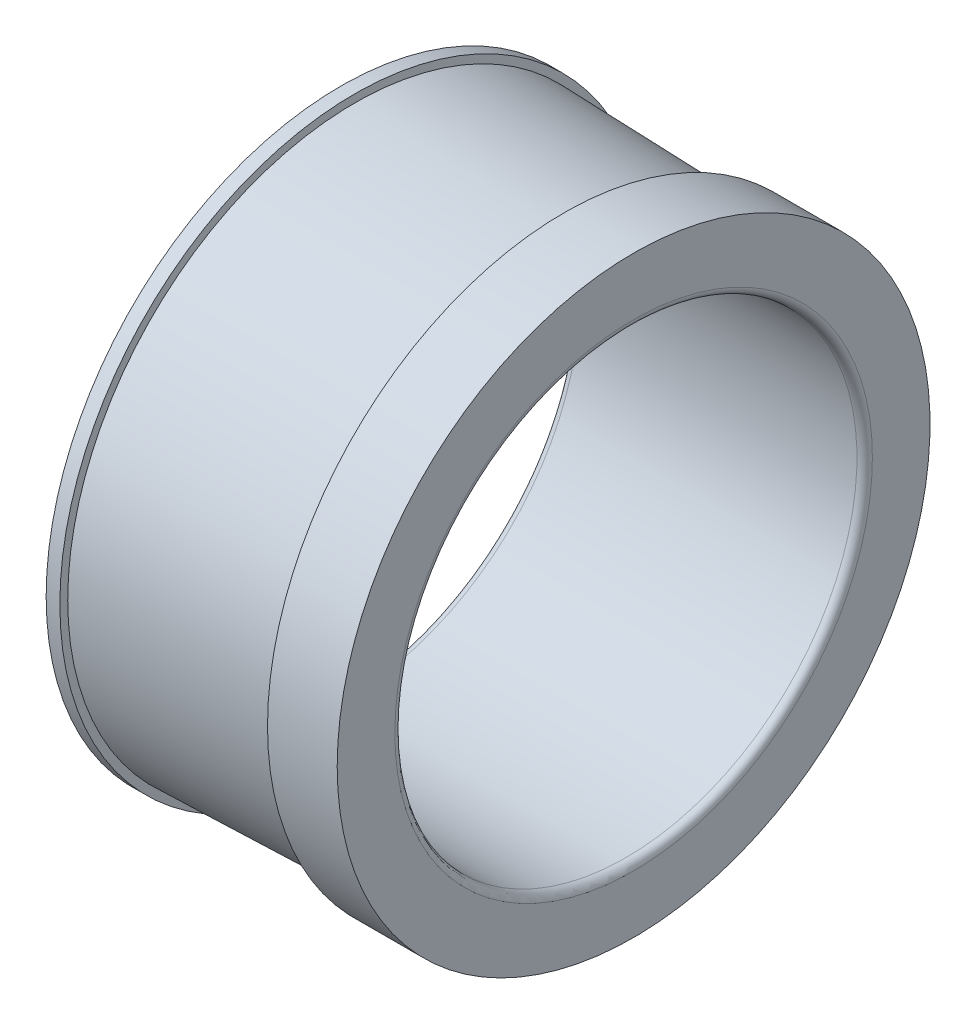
ISO-10303-21;
HEADER;
FILE_DESCRIPTION(('STEP AP214'),'2;1');
FILE_NAME('part.step','',(''),(''),'','','');
FILE_SCHEMA(('AUTOMOTIVE_DESIGN { 1 0 10303 214 1 1 1 1 }'));
ENDSEC;
DATA;
#1=APPLICATION_CONTEXT('core data for automotive mechanical design processes');
#2=APPLICATION_PROTOCOL_DEFINITION('international standard','automotive_design',2000,#1);
#3=PRODUCT_CONTEXT('',#1,'mechanical');
#4=PRODUCT('Part','Part','',(#3));
#5=PRODUCT_RELATED_PRODUCT_CATEGORY('part','',(#4));
#6=PRODUCT_DEFINITION_FORMATION('','',#4);
#7=PRODUCT_DEFINITION_CONTEXT('part definition',#1,'design');
#8=PRODUCT_DEFINITION('design','',#6,#7);
#9=PRODUCT_DEFINITION_SHAPE('','',#8);
#10=(LENGTH_UNIT() NAMED_UNIT(*) SI_UNIT(.MILLI.,.METRE.));
#11=(NAMED_UNIT(*) PLANE_ANGLE_UNIT() SI_UNIT($,.RADIAN.));
#12=(NAMED_UNIT(*) SI_UNIT($,.STERADIAN.) SOLID_ANGLE_UNIT());
#13=UNCERTAINTY_MEASURE_WITH_UNIT(LENGTH_MEASURE(1.E-05),#10,'distance_accuracy_value','');
#14=(GEOMETRIC_REPRESENTATION_CONTEXT(3) GLOBAL_UNCERTAINTY_ASSIGNED_CONTEXT((#13)) GLOBAL_UNIT_ASSIGNED_CONTEXT((#10,
#11,#12)) REPRESENTATION_CONTEXT('',''));
#15=CARTESIAN_POINT('',(0.,0.,0.));
#16=DIRECTION('',(0.,0.,1.));
#17=DIRECTION('',(1.,0.,0.));
#18=AXIS2_PLACEMENT_3D('',#15,#16,#17);
#19=CARTESIAN_POINT('',(1.,0.,0.));
#20=DIRECTION('',(-1.,0.,0.));
#21=DIRECTION('',(0.,0.,1.));
#22=AXIS2_PLACEMENT_3D('',#19,#20,#21);
#23=TOROIDAL_SURFACE('',#22,31.,1.);
#24=CARTESIAN_POINT('',(1.,0.,0.));
#25=DIRECTION('',(-1.,0.,0.));
#26=DIRECTION('',(0.,0.,1.));
#27=AXIS2_PLACEMENT_3D('',#24,#25,#26);
#28=CIRCLE('',#27,30.);
#29=CARTESIAN_POINT('',(1.,0.,30.));
#30=VERTEX_POINT('',#29);
#31=EDGE_CURVE('E10',#30,#30,#28,.T.);
#32=ORIENTED_EDGE('',*,*,#31,.F.);
#33=EDGE_LOOP('',(#32));
#34=FACE_BOUND('',#33,.T.);
#35=CARTESIAN_POINT('',(0.,0.,0.));
#36=DIRECTION('',(-1.,0.,0.));
#37=DIRECTION('',(0.,0.,1.));
#38=AXIS2_PLACEMENT_3D('',#35,#36,#37);
#39=CIRCLE('',#38,31.);
#40=CARTESIAN_POINT('',(0.,0.,31.));
#41=VERTEX_POINT('',#40);
#42=EDGE_CURVE('E63',#41,#41,#39,.T.);
#43=ORIENTED_EDGE('',*,*,#42,.T.);
#44=EDGE_LOOP('',(#43));
#45=FACE_BOUND('',#44,.T.);
#46=ADVANCED_FACE('F29',(#34,#45),#23,.T.);
#47=CARTESIAN_POINT('',(0.,0.,0.));
#48=DIRECTION('',(-1.,0.,0.));
#49=DIRECTION('',(0.,0.,1.));
#50=AXIS2_PLACEMENT_3D('',#47,#48,#49);
#51=CYLINDRICAL_SURFACE('',#50,30.);
#52=CARTESIAN_POINT('',(37.,0.,0.));
#53=DIRECTION('',(-1.,0.,0.));
#54=DIRECTION('',(0.,0.,1.));
#55=AXIS2_PLACEMENT_3D('',#52,#53,#54);
#56=CIRCLE('',#55,30.);
#57=CARTESIAN_POINT('',(37.,0.,30.));
#58=VERTEX_POINT('',#57);
#59=EDGE_CURVE('E35',#58,#58,#56,.T.);
#60=ORIENTED_EDGE('',*,*,#59,.F.);
#61=EDGE_LOOP('',(#60));
#62=FACE_BOUND('',#61,.T.);
#63=ORIENTED_EDGE('',*,*,#31,.T.);
#64=EDGE_LOOP('',(#63));
#65=FACE_BOUND('',#64,.T.);
#66=ADVANCED_FACE('F112',(#62,#65),#51,.F.);
#67=CARTESIAN_POINT('',(37.,0.,0.));
#68=DIRECTION('',(-1.,0.,0.));
#69=DIRECTION('',(0.,0.,1.));
#70=AXIS2_PLACEMENT_3D('',#67,#68,#69);
#71=TOROIDAL_SURFACE('',#70,31.,1.);
#72=CARTESIAN_POINT('',(38.,0.,0.));
#73=DIRECTION('',(-1.,0.,0.));
#74=DIRECTION('',(0.,0.,1.));
#75=AXIS2_PLACEMENT_3D('',#72,#73,#74);
#76=CIRCLE('',#75,31.);
#77=CARTESIAN_POINT('',(38.,0.,31.));
#78=VERTEX_POINT('',#77);
#79=EDGE_CURVE('E39',#78,#78,#76,.T.);
#80=ORIENTED_EDGE('',*,*,#79,.F.);
#81=EDGE_LOOP('',(#80));
#82=FACE_BOUND('',#81,.T.);
#83=ORIENTED_EDGE('',*,*,#59,.T.);
#84=EDGE_LOOP('',(#83));
#85=FACE_BOUND('',#84,.T.);
#86=ADVANCED_FACE('F107',(#82,#85),#71,.T.);
#87=CARTESIAN_POINT('',(38.,0.,-38.4835642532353));
#88=DIRECTION('',(-1.,0.,0.));
#89=DIRECTION('',(0.,0.,1.));
#90=AXIS2_PLACEMENT_3D('',#87,#88,#89);
#91=PLANE('',#90);
#92=CARTESIAN_POINT('',(38.,0.,0.));
#93=DIRECTION('',(-1.,0.,0.));
#94=DIRECTION('',(0.,0.,1.));
#95=AXIS2_PLACEMENT_3D('',#92,#93,#94);
#96=CIRCLE('',#95,38.4835642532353);
#97=CARTESIAN_POINT('',(38.,0.,38.4835642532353));
#98=VERTEX_POINT('',#97);
#99=EDGE_CURVE('E43',#98,#98,#96,.T.);
#100=ORIENTED_EDGE('',*,*,#99,.F.);
#101=EDGE_LOOP('',(#100));
#102=FACE_BOUND('',#101,.T.);
#103=ORIENTED_EDGE('',*,*,#79,.T.);
#104=EDGE_LOOP('',(#103));
#105=FACE_BOUND('',#104,.T.);
#106=ADVANCED_FACE('F101',(#102,#105),#91,.F.);
#107=CARTESIAN_POINT('',(0.,0.,0.));
#108=DIRECTION('',(-1.,0.,0.));
#109=DIRECTION('',(0.,0.,1.));
#110=AXIS2_PLACEMENT_3D('',#107,#108,#109);
#111=CYLINDRICAL_SURFACE('',#110,38.4835642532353);
#112=CARTESIAN_POINT('',(28.9529411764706,0.,0.));
#113=DIRECTION('',(-1.,0.,0.));
#114=DIRECTION('',(0.,0.,1.));
#115=AXIS2_PLACEMENT_3D('',#112,#113,#114);
#116=CIRCLE('',#115,38.4835642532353);
#117=CARTESIAN_POINT('',(28.9529411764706,0.,38.4835642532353));
#118=VERTEX_POINT('',#117);
#119=EDGE_CURVE('E48',#118,#118,#116,.T.);
#120=ORIENTED_EDGE('',*,*,#119,.F.);
#121=EDGE_LOOP('',(#120));
#122=FACE_BOUND('',#121,.T.);
#123=ORIENTED_EDGE('',*,*,#99,.T.);
#124=EDGE_LOOP('',(#123));
#125=FACE_BOUND('',#124,.T.);
#126=ADVANCED_FACE('F95',(#122,#125),#111,.T.);
#127=CARTESIAN_POINT('',(28.9529411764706,0.,0.));
#128=DIRECTION('',(-1.,0.,0.));
#129=DIRECTION('',(0.,0.,1.));
#130=AXIS2_PLACEMENT_3D('',#127,#128,#129);
#131=CONICAL_SURFACE('',#130,38.4835642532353,1.54727125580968);
#132=CARTESIAN_POINT('',(29.,0.,0.));
#133=DIRECTION('',(-1.,0.,0.));
#134=DIRECTION('',(0.,0.,1.));
#135=AXIS2_PLACEMENT_3D('',#132,#133,#134);
#136=CIRCLE('',#135,36.4835642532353);
#137=CARTESIAN_POINT('',(29.,0.,36.4835642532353));
#138=VERTEX_POINT('',#137);
#139=EDGE_CURVE('E51',#138,#138,#136,.T.);
#140=ORIENTED_EDGE('',*,*,#139,.F.);
#141=EDGE_LOOP('',(#140));
#142=FACE_BOUND('',#141,.T.);
#143=ORIENTED_EDGE('',*,*,#119,.T.);
#144=EDGE_LOOP('',(#143));
#145=FACE_BOUND('',#144,.T.);
#146=ADVANCED_FACE('F89',(#142,#145),#131,.F.);
#147=CARTESIAN_POINT('',(29.,0.,0.));
#148=DIRECTION('',(-1.,0.,0.));
#149=DIRECTION('',(0.,0.,1.));
#150=AXIS2_PLACEMENT_3D('',#147,#148,#149);
#151=CONICAL_SURFACE('',#150,36.4835642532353,0.0288348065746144);
#152=CARTESIAN_POINT('',(1.80141360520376,0.,0.));
#153=DIRECTION('',(-1.,0.,0.));
#154=DIRECTION('',(0.,0.,1.));
#155=AXIS2_PLACEMENT_3D('',#152,#153,#154);
#156=CIRCLE('',#155,37.2680476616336);
#157=CARTESIAN_POINT('',(1.80141360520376,0.,37.2680476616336));
#158=VERTEX_POINT('',#157);
#159=EDGE_CURVE('E54',#158,#158,#156,.T.);
#160=ORIENTED_EDGE('',*,*,#159,.F.);
#161=EDGE_LOOP('',(#160));
#162=FACE_BOUND('',#161,.T.);
#163=ORIENTED_EDGE('',*,*,#139,.T.);
#164=EDGE_LOOP('',(#163));
#165=FACE_BOUND('',#164,.T.);
#166=ADVANCED_FACE('F83',(#162,#165),#151,.T.);
#167=CARTESIAN_POINT('',(1.80141360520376,0.,0.));
#168=DIRECTION('',(-1.,0.,0.));
#169=DIRECTION('',(0.,0.,1.));
#170=AXIS2_PLACEMENT_3D('',#167,#168,#169);
#171=CONICAL_SURFACE('',#170,37.2680476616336,1.54727125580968);
#172=CARTESIAN_POINT('',(1.77788419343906,0.,0.));
#173=DIRECTION('',(-1.,0.,0.));
#174=DIRECTION('',(0.,0.,1.));
#175=AXIS2_PLACEMENT_3D('',#172,#173,#174);
#176=CIRCLE('',#175,38.2680476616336);
#177=CARTESIAN_POINT('',(1.77788419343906,0.,38.2680476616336));
#178=VERTEX_POINT('',#177);
#179=EDGE_CURVE('E57',#178,#178,#176,.T.);
#180=ORIENTED_EDGE('',*,*,#179,.F.);
#181=EDGE_LOOP('',(#180));
#182=FACE_BOUND('',#181,.T.);
#183=ORIENTED_EDGE('',*,*,#159,.T.);
#184=EDGE_LOOP('',(#183));
#185=FACE_BOUND('',#184,.T.);
#186=ADVANCED_FACE('F77',(#182,#185),#171,.T.);
#187=CARTESIAN_POINT('',(0.,0.,0.));
#188=DIRECTION('',(-1.,0.,0.));
#189=DIRECTION('',(0.,0.,1.));
#190=AXIS2_PLACEMENT_3D('',#187,#188,#189);
#191=CYLINDRICAL_SURFACE('',#190,38.2680476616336);
#192=CARTESIAN_POINT('',(0.,0.,0.));
#193=DIRECTION('',(-1.,0.,0.));
#194=DIRECTION('',(0.,0.,1.));
#195=AXIS2_PLACEMENT_3D('',#192,#193,#194);
#196=CIRCLE('',#195,38.2680476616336);
#197=CARTESIAN_POINT('',(0.,0.,38.2680476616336));
#198=VERTEX_POINT('',#197);
#199=EDGE_CURVE('E60',#198,#198,#196,.T.);
#200=ORIENTED_EDGE('',*,*,#199,.F.);
#201=EDGE_LOOP('',(#200));
#202=FACE_BOUND('',#201,.T.);
#203=ORIENTED_EDGE('',*,*,#179,.T.);
#204=EDGE_LOOP('',(#203));
#205=FACE_BOUND('',#204,.T.);
#206=ADVANCED_FACE('F71',(#202,#205),#191,.T.);
#207=CARTESIAN_POINT('',(0.,0.,-31.));
#208=DIRECTION('',(1.,0.,0.));
#209=DIRECTION('',(0.,0.,-1.));
#210=AXIS2_PLACEMENT_3D('',#207,#208,#209);
#211=PLANE('',#210);
#212=ORIENTED_EDGE('',*,*,#42,.F.);
#213=EDGE_LOOP('',(#212));
#214=FACE_BOUND('',#213,.T.);
#215=ORIENTED_EDGE('',*,*,#199,.T.);
#216=EDGE_LOOP('',(#215));
#217=FACE_BOUND('',#216,.T.);
#218=ADVANCED_FACE('F68',(#214,#217),#211,.F.);
#219=CLOSED_SHELL('',(#46,#66,#86,#106,#126,#146,#166,#186,#206,#218));
#220=MANIFOLD_SOLID_BREP('B2',#219);
#221=ADVANCED_BREP_SHAPE_REPRESENTATION('',(#18,#220),#14);
#222=SHAPE_DEFINITION_REPRESENTATION(#9,#221);
ENDSEC;
END-ISO-10303-21;
